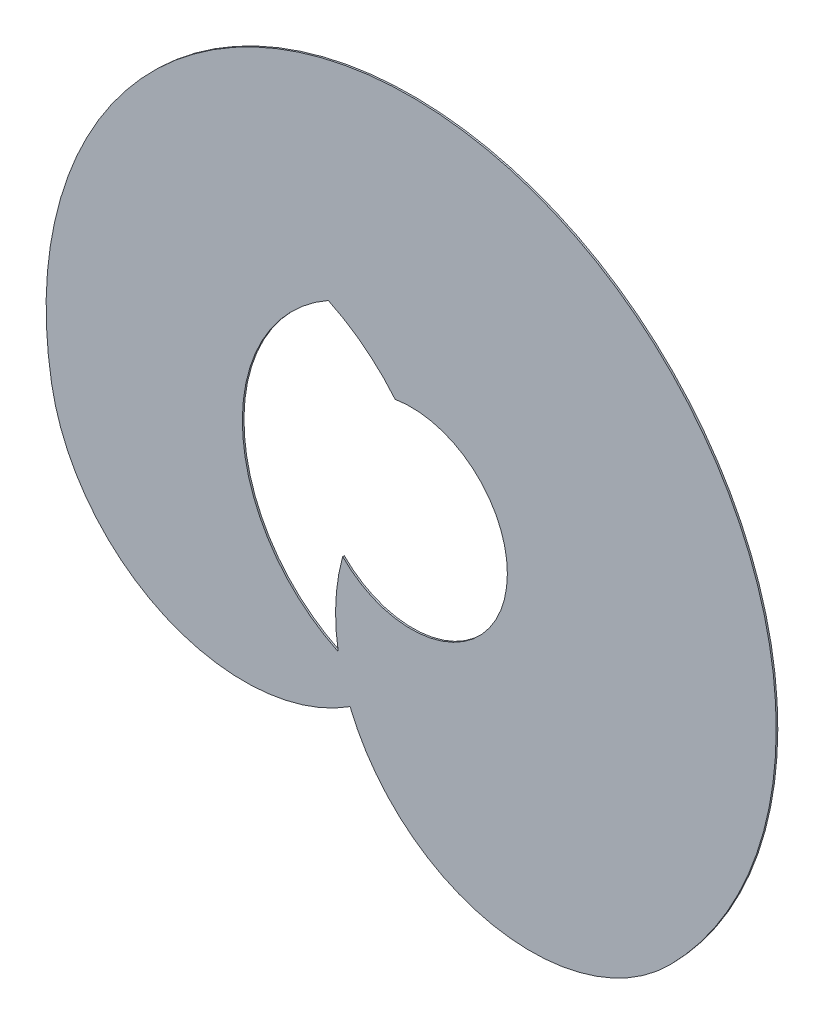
ISO-10303-21;
HEADER;
FILE_DESCRIPTION(('STEP AP214'),'2;1');
FILE_NAME('part.step','',(''),(''),'','','');
FILE_SCHEMA(('AUTOMOTIVE_DESIGN { 1 0 10303 214 1 1 1 1 }'));
ENDSEC;
DATA;
#1=APPLICATION_CONTEXT('core data for automotive mechanical design processes');
#2=APPLICATION_PROTOCOL_DEFINITION('international standard','automotive_design',2000,#1);
#3=PRODUCT_CONTEXT('',#1,'mechanical');
#4=PRODUCT('Part','Part','',(#3));
#5=PRODUCT_RELATED_PRODUCT_CATEGORY('part','',(#4));
#6=PRODUCT_DEFINITION_FORMATION('','',#4);
#7=PRODUCT_DEFINITION_CONTEXT('part definition',#1,'design');
#8=PRODUCT_DEFINITION('design','',#6,#7);
#9=PRODUCT_DEFINITION_SHAPE('','',#8);
#10=(LENGTH_UNIT() NAMED_UNIT(*) SI_UNIT(.MILLI.,.METRE.));
#11=(NAMED_UNIT(*) PLANE_ANGLE_UNIT() SI_UNIT($,.RADIAN.));
#12=(NAMED_UNIT(*) SI_UNIT($,.STERADIAN.) SOLID_ANGLE_UNIT());
#13=UNCERTAINTY_MEASURE_WITH_UNIT(LENGTH_MEASURE(1.E-05),#10,'distance_accuracy_value','');
#14=(GEOMETRIC_REPRESENTATION_CONTEXT(3) GLOBAL_UNCERTAINTY_ASSIGNED_CONTEXT((#13)) GLOBAL_UNIT_ASSIGNED_CONTEXT((#10,
#11,#12)) REPRESENTATION_CONTEXT('',''));
#15=CARTESIAN_POINT('',(0.,0.,0.));
#16=DIRECTION('',(0.,0.,1.));
#17=DIRECTION('',(1.,0.,0.));
#18=AXIS2_PLACEMENT_3D('',#15,#16,#17);
#19=CARTESIAN_POINT('',(-19.1544545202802,259.959961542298,-198.5));
#20=DIRECTION('',(0.,0.,1.));
#21=DIRECTION('',(1.,0.,0.));
#22=AXIS2_PLACEMENT_3D('',#19,#20,#21);
#23=PLANE('',#22);
#24=CARTESIAN_POINT('',(-288.168865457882,344.779879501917,-198.5));
#25=DIRECTION('',(0.,0.,1.));
#26=DIRECTION('',(1.,0.,0.));
#27=AXIS2_PLACEMENT_3D('',#24,#25,#26);
#28=CIRCLE('',#27,366.674242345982);
#29=CARTESIAN_POINT('',(-649.272502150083,281.107565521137,-198.5));
#30=VERTEX_POINT('',#29);
#31=CARTESIAN_POINT('',(-89.6036230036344,36.5237449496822,-198.5));
#32=VERTEX_POINT('',#31);
#33=EDGE_CURVE('E129',#30,#32,#28,.T.);
#34=ORIENTED_EDGE('',*,*,#33,.T.);
#35=CARTESIAN_POINT('',(249.859956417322,175.140043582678,-198.5));
#36=DIRECTION('',(0.,0.,1.));
#37=DIRECTION('',(1.,0.,0.));
#38=AXIS2_PLACEMENT_3D('',#35,#36,#37);
#39=CIRCLE('',#38,366.674242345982);
#40=CARTESIAN_POINT('',(509.137799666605,-84.1377996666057,-198.5));
#41=VERTEX_POINT('',#40);
#42=EDGE_CURVE('E132',#32,#41,#39,.T.);
#43=ORIENTED_EDGE('',*,*,#42,.T.);
#44=CARTESIAN_POINT('',(25.,400.,-198.5));
#45=DIRECTION('',(0.,0.,1.));
#46=DIRECTION('',(1.,0.,0.));
#47=AXIS2_PLACEMENT_3D('',#44,#45,#46);
#48=CIRCLE('',#47,684.674242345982);
#49=EDGE_CURVE('E135',#41,#30,#48,.T.);
#50=ORIENTED_EDGE('',*,*,#49,.T.);
#51=EDGE_LOOP('',(#34,#43,#50));
#52=FACE_BOUND('',#51,.T.);
#53=CARTESIAN_POINT('',(-288.168865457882,344.779879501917,-198.5));
#54=DIRECTION('',(0.,0.,1.));
#55=DIRECTION('',(1.,0.,0.));
#56=AXIS2_PLACEMENT_3D('',#53,#54,#55);
#57=CIRCLE('',#56,366.674242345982);
#58=CARTESIAN_POINT('',(-5.14190309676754,577.901604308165,-198.5));
#59=VERTEX_POINT('',#58);
#60=CARTESIAN_POINT('',(-130.442271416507,675.796981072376,-198.5));
#61=VERTEX_POINT('',#60);
#62=EDGE_CURVE('E101',#59,#61,#57,.T.);
#63=ORIENTED_EDGE('',*,*,#62,.F.);
#64=CARTESIAN_POINT('',(25.,400.,-198.5));
#65=DIRECTION('',(0.,0.,1.));
#66=DIRECTION('',(1.,0.,0.));
#67=AXIS2_PLACEMENT_3D('',#64,#65,#66);
#68=CIRCLE('',#67,180.437011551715);
#69=CARTESIAN_POINT('',(-103.439777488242,273.269030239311,-198.5));
#70=VERTEX_POINT('',#69);
#71=EDGE_CURVE('E93',#70,#59,#68,.T.);
#72=ORIENTED_EDGE('',*,*,#71,.F.);
#73=CARTESIAN_POINT('',(249.859956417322,175.140043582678,-198.5));
#74=DIRECTION('',(0.,0.,-1.));
#75=DIRECTION('',(1.,0.,0.));
#76=AXIS2_PLACEMENT_3D('',#73,#74,#75);
#77=CIRCLE('',#76,366.674242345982);
#78=CARTESIAN_POINT('',(-111.761636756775,114.478496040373,-198.5));
#79=VERTEX_POINT('',#78);
#80=EDGE_CURVE('E115',#79,#70,#77,.T.);
#81=ORIENTED_EDGE('',*,*,#80,.F.);
#82=CARTESIAN_POINT('',(25.,400.,-198.5));
#83=DIRECTION('',(0.,0.,1.));
#84=DIRECTION('',(1.,0.,0.));
#85=AXIS2_PLACEMENT_3D('',#82,#83,#84);
#86=CIRCLE('',#85,316.585335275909);
#87=EDGE_CURVE('E113',#61,#79,#86,.T.);
#88=ORIENTED_EDGE('',*,*,#87,.F.);
#89=EDGE_LOOP('',(#63,#72,#81,#88));
#90=FACE_BOUND('',#89,.T.);
#91=ADVANCED_FACE('F34',(#52,#90),#23,.T.);
#92=CARTESIAN_POINT('',(-19.1544545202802,259.959961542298,-201.5));
#93=DIRECTION('',(0.,0.,1.));
#94=DIRECTION('',(1.,0.,0.));
#95=AXIS2_PLACEMENT_3D('',#92,#93,#94);
#96=PLANE('',#95);
#97=CARTESIAN_POINT('',(-288.168865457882,344.779879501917,-201.5));
#98=DIRECTION('',(0.,0.,1.));
#99=DIRECTION('',(1.,0.,0.));
#100=AXIS2_PLACEMENT_3D('',#97,#98,#99);
#101=CIRCLE('',#100,366.674242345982);
#102=CARTESIAN_POINT('',(-649.272502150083,281.107565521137,-201.5));
#103=VERTEX_POINT('',#102);
#104=CARTESIAN_POINT('',(-89.6036230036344,36.5237449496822,-201.5));
#105=VERTEX_POINT('',#104);
#106=EDGE_CURVE('E109',#103,#105,#101,.T.);
#107=ORIENTED_EDGE('',*,*,#106,.F.);
#108=CARTESIAN_POINT('',(25.,400.,-201.5));
#109=DIRECTION('',(0.,0.,1.));
#110=DIRECTION('',(1.,0.,0.));
#111=AXIS2_PLACEMENT_3D('',#108,#109,#110);
#112=CIRCLE('',#111,684.674242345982);
#113=CARTESIAN_POINT('',(509.137799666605,-84.1377996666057,-201.5));
#114=VERTEX_POINT('',#113);
#115=EDGE_CURVE('E133',#114,#103,#112,.T.);
#116=ORIENTED_EDGE('',*,*,#115,.F.);
#117=CARTESIAN_POINT('',(249.859956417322,175.140043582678,-201.5));
#118=DIRECTION('',(0.,0.,1.));
#119=DIRECTION('',(1.,0.,0.));
#120=AXIS2_PLACEMENT_3D('',#117,#118,#119);
#121=CIRCLE('',#120,366.674242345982);
#122=EDGE_CURVE('E140',#105,#114,#121,.T.);
#123=ORIENTED_EDGE('',*,*,#122,.F.);
#124=EDGE_LOOP('',(#107,#116,#123));
#125=FACE_BOUND('',#124,.T.);
#126=CARTESIAN_POINT('',(25.,400.,-201.5));
#127=DIRECTION('',(0.,0.,1.));
#128=DIRECTION('',(1.,0.,0.));
#129=AXIS2_PLACEMENT_3D('',#126,#127,#128);
#130=CIRCLE('',#129,180.437011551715);
#131=CARTESIAN_POINT('',(-103.439777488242,273.269030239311,-201.5));
#132=VERTEX_POINT('',#131);
#133=CARTESIAN_POINT('',(-5.14190309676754,577.901604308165,-201.5));
#134=VERTEX_POINT('',#133);
#135=EDGE_CURVE('E57',#132,#134,#130,.T.);
#136=ORIENTED_EDGE('',*,*,#135,.T.);
#137=CARTESIAN_POINT('',(-288.168865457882,344.779879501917,-201.5));
#138=DIRECTION('',(0.,0.,1.));
#139=DIRECTION('',(1.,0.,0.));
#140=AXIS2_PLACEMENT_3D('',#137,#138,#139);
#141=CIRCLE('',#140,366.674242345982);
#142=CARTESIAN_POINT('',(-130.442271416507,675.796981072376,-201.5));
#143=VERTEX_POINT('',#142);
#144=EDGE_CURVE('E108',#134,#143,#141,.T.);
#145=ORIENTED_EDGE('',*,*,#144,.T.);
#146=CARTESIAN_POINT('',(25.,400.,-201.5));
#147=DIRECTION('',(0.,0.,1.));
#148=DIRECTION('',(1.,0.,0.));
#149=AXIS2_PLACEMENT_3D('',#146,#147,#148);
#150=CIRCLE('',#149,316.585335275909);
#151=CARTESIAN_POINT('',(-111.761636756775,114.478496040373,-201.5));
#152=VERTEX_POINT('',#151);
#153=EDGE_CURVE('E121',#143,#152,#150,.T.);
#154=ORIENTED_EDGE('',*,*,#153,.T.);
#155=CARTESIAN_POINT('',(249.859956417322,175.140043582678,-201.5));
#156=DIRECTION('',(0.,0.,-1.));
#157=DIRECTION('',(1.,0.,0.));
#158=AXIS2_PLACEMENT_3D('',#155,#156,#157);
#159=CIRCLE('',#158,366.674242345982);
#160=EDGE_CURVE('E102',#152,#132,#159,.T.);
#161=ORIENTED_EDGE('',*,*,#160,.T.);
#162=EDGE_LOOP('',(#136,#145,#154,#161));
#163=FACE_BOUND('',#162,.T.);
#164=ADVANCED_FACE('F154',(#125,#163),#96,.F.);
#165=CARTESIAN_POINT('',(-288.168865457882,344.779879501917,-198.5));
#166=DIRECTION('',(0.,0.,-1.));
#167=DIRECTION('',(-1.,0.,0.));
#168=AXIS2_PLACEMENT_3D('',#165,#166,#167);
#169=CYLINDRICAL_SURFACE('',#168,366.674242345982);
#170=ORIENTED_EDGE('',*,*,#106,.T.);
#171=DIRECTION('',(0.,0.,-1.));
#172=VECTOR('',#171,1.);
#173=CARTESIAN_POINT('',(-89.6036230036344,36.5237449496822,-198.5));
#174=LINE('',#173,#172);
#175=EDGE_CURVE('E11',#32,#105,#174,.T.);
#176=ORIENTED_EDGE('',*,*,#175,.F.);
#177=ORIENTED_EDGE('',*,*,#33,.F.);
#178=DIRECTION('',(0.,0.,-1.));
#179=VECTOR('',#178,1.);
#180=CARTESIAN_POINT('',(-649.272502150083,281.107565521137,-198.5));
#181=LINE('',#180,#179);
#182=EDGE_CURVE('E137',#30,#103,#181,.T.);
#183=ORIENTED_EDGE('',*,*,#182,.T.);
#184=EDGE_LOOP('',(#170,#176,#177,#183));
#185=FACE_BOUND('',#184,.T.);
#186=ADVANCED_FACE('F36',(#185),#169,.T.);
#187=CARTESIAN_POINT('',(249.859956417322,175.140043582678,-198.5));
#188=DIRECTION('',(0.,0.,-1.));
#189=DIRECTION('',(-1.,0.,0.));
#190=AXIS2_PLACEMENT_3D('',#187,#188,#189);
#191=CYLINDRICAL_SURFACE('',#190,366.674242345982);
#192=ORIENTED_EDGE('',*,*,#122,.T.);
#193=DIRECTION('',(0.,0.,-1.));
#194=VECTOR('',#193,1.);
#195=CARTESIAN_POINT('',(509.137799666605,-84.1377996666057,-198.5));
#196=LINE('',#195,#194);
#197=EDGE_CURVE('E42',#41,#114,#196,.T.);
#198=ORIENTED_EDGE('',*,*,#197,.F.);
#199=ORIENTED_EDGE('',*,*,#42,.F.);
#200=ORIENTED_EDGE('',*,*,#175,.T.);
#201=EDGE_LOOP('',(#192,#198,#199,#200));
#202=FACE_BOUND('',#201,.T.);
#203=ADVANCED_FACE('F160',(#202),#191,.T.);
#204=CARTESIAN_POINT('',(25.,400.,-198.5));
#205=DIRECTION('',(0.,0.,-1.));
#206=DIRECTION('',(-1.,0.,0.));
#207=AXIS2_PLACEMENT_3D('',#204,#205,#206);
#208=CYLINDRICAL_SURFACE('',#207,684.674242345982);
#209=ORIENTED_EDGE('',*,*,#115,.T.);
#210=ORIENTED_EDGE('',*,*,#182,.F.);
#211=ORIENTED_EDGE('',*,*,#49,.F.);
#212=ORIENTED_EDGE('',*,*,#197,.T.);
#213=EDGE_LOOP('',(#209,#210,#211,#212));
#214=FACE_BOUND('',#213,.T.);
#215=ADVANCED_FACE('F149',(#214),#208,.T.);
#216=CARTESIAN_POINT('',(25.,400.,-198.5));
#217=DIRECTION('',(0.,0.,-1.));
#218=DIRECTION('',(-1.,0.,0.));
#219=AXIS2_PLACEMENT_3D('',#216,#217,#218);
#220=CYLINDRICAL_SURFACE('',#219,180.437011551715);
#221=ORIENTED_EDGE('',*,*,#135,.F.);
#222=DIRECTION('',(0.,0.,-1.));
#223=VECTOR('',#222,1.);
#224=CARTESIAN_POINT('',(-103.439777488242,273.269030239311,-198.5));
#225=LINE('',#224,#223);
#226=EDGE_CURVE('E97',#70,#132,#225,.T.);
#227=ORIENTED_EDGE('',*,*,#226,.F.);
#228=ORIENTED_EDGE('',*,*,#71,.T.);
#229=DIRECTION('',(0.,0.,-1.));
#230=VECTOR('',#229,1.);
#231=CARTESIAN_POINT('',(-5.14190309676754,577.901604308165,-198.5));
#232=LINE('',#231,#230);
#233=EDGE_CURVE('E96',#59,#134,#232,.T.);
#234=ORIENTED_EDGE('',*,*,#233,.T.);
#235=EDGE_LOOP('',(#221,#227,#228,#234));
#236=FACE_BOUND('',#235,.T.);
#237=ADVANCED_FACE('F95',(#236),#220,.F.);
#238=CARTESIAN_POINT('',(-288.168865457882,344.779879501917,-198.5));
#239=DIRECTION('',(0.,0.,-1.));
#240=DIRECTION('',(-1.,0.,0.));
#241=AXIS2_PLACEMENT_3D('',#238,#239,#240);
#242=CYLINDRICAL_SURFACE('',#241,366.674242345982);
#243=ORIENTED_EDGE('',*,*,#144,.F.);
#244=ORIENTED_EDGE('',*,*,#233,.F.);
#245=ORIENTED_EDGE('',*,*,#62,.T.);
#246=DIRECTION('',(0.,0.,-1.));
#247=VECTOR('',#246,1.);
#248=CARTESIAN_POINT('',(-130.442271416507,675.796981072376,-198.5));
#249=LINE('',#248,#247);
#250=EDGE_CURVE('E110',#61,#143,#249,.T.);
#251=ORIENTED_EDGE('',*,*,#250,.T.);
#252=EDGE_LOOP('',(#243,#244,#245,#251));
#253=FACE_BOUND('',#252,.T.);
#254=ADVANCED_FACE('F105',(#253),#242,.F.);
#255=CARTESIAN_POINT('',(25.,400.,-198.5));
#256=DIRECTION('',(0.,0.,-1.));
#257=DIRECTION('',(-1.,0.,0.));
#258=AXIS2_PLACEMENT_3D('',#255,#256,#257);
#259=CYLINDRICAL_SURFACE('',#258,316.585335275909);
#260=ORIENTED_EDGE('',*,*,#153,.F.);
#261=ORIENTED_EDGE('',*,*,#250,.F.);
#262=ORIENTED_EDGE('',*,*,#87,.T.);
#263=DIRECTION('',(0.,0.,-1.));
#264=VECTOR('',#263,1.);
#265=CARTESIAN_POINT('',(-111.761636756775,114.478496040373,-198.5));
#266=LINE('',#265,#264);
#267=EDGE_CURVE('E49',#79,#152,#266,.T.);
#268=ORIENTED_EDGE('',*,*,#267,.T.);
#269=EDGE_LOOP('',(#260,#261,#262,#268));
#270=FACE_BOUND('',#269,.T.);
#271=ADVANCED_FACE('F178',(#270),#259,.F.);
#272=CARTESIAN_POINT('',(249.859956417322,175.140043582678,-198.5));
#273=DIRECTION('',(0.,0.,-1.));
#274=DIRECTION('',(-1.,0.,0.));
#275=AXIS2_PLACEMENT_3D('',#272,#273,#274);
#276=CYLINDRICAL_SURFACE('',#275,366.674242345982);
#277=ORIENTED_EDGE('',*,*,#160,.F.);
#278=ORIENTED_EDGE('',*,*,#267,.F.);
#279=ORIENTED_EDGE('',*,*,#80,.T.);
#280=ORIENTED_EDGE('',*,*,#226,.T.);
#281=EDGE_LOOP('',(#277,#278,#279,#280));
#282=FACE_BOUND('',#281,.T.);
#283=ADVANCED_FACE('F181',(#282),#276,.T.);
#284=CLOSED_SHELL('',(#91,#164,#186,#203,#215,#237,#254,#271,#283));
#285=MANIFOLD_SOLID_BREP('B2',#284);
#286=ADVANCED_BREP_SHAPE_REPRESENTATION('',(#18,#285),#14);
#287=SHAPE_DEFINITION_REPRESENTATION(#9,#286);
ENDSEC;
END-ISO-10303-21;
